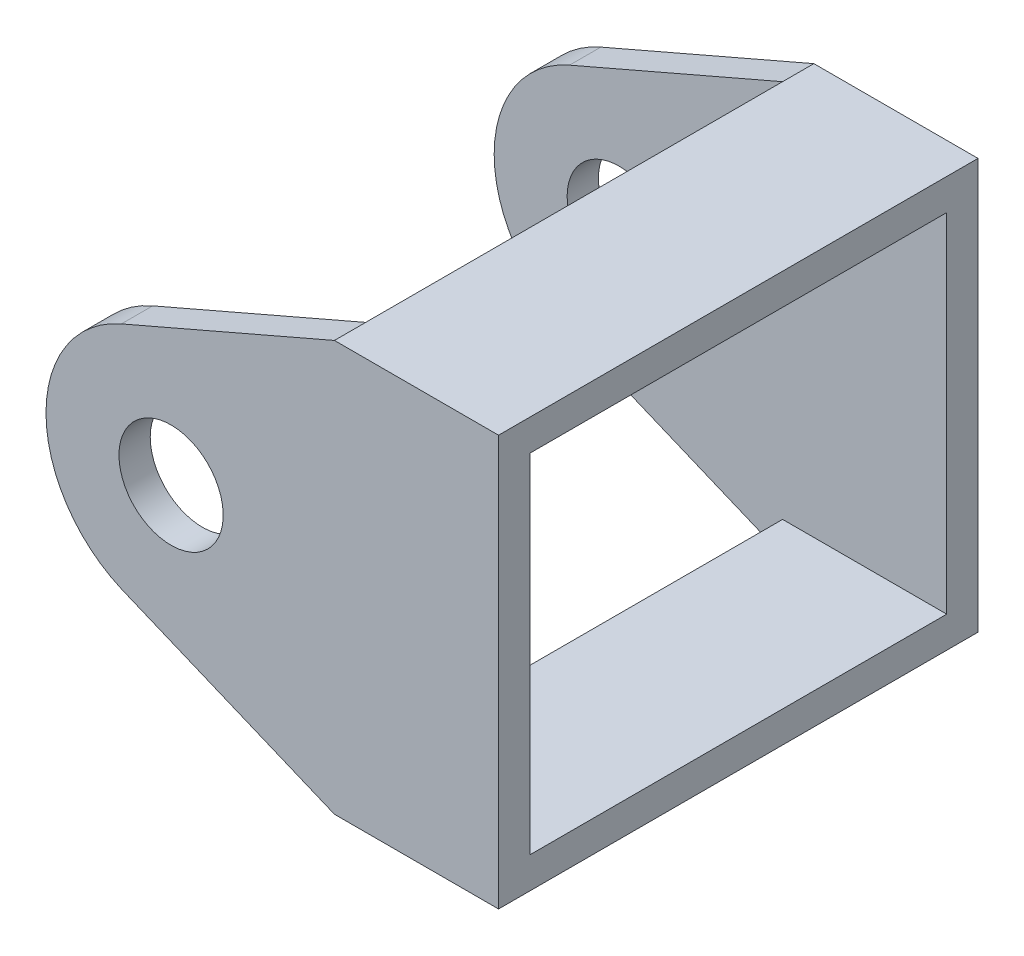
from build123d import *

# Parameters (mm, degrees)
SKETCH1_R               = 6.35
BOSS_EXTRUDE1_DEPTH     = 58.42
CUT_EXTRUDE1_DEPTH      = 20
CUT_EXTRUDE1_DEPTH_BACK = 85.135726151
SKETCH2_W               = 50.8
SKETCH2_H               = 42.38
CUT_EXTRUDE2_DEPTH      = 15
CUT_EXTRUDE2_DEPTH_BACK = 59
SKETCH3_W               = 14.655181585
SKETCH3_H               = 50.8


with BuildPart() as part:
    # Sketch1 → Boss-Extrude1 (new body)
    with BuildSketch(Plane.XY):
        with BuildLine():
            Line((0, 25), (-20, 25))
            Line((-20, 25), (-45.957720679, 13.7657403))
            ThreePointArc((-45.957720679, 13.7657403), (-55.144573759, -0.220574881), (-45.957720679, -14.206890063))
            Line((-45.957720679, -14.206890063), (-20, -25))
            Line((-20, -25), (0, -25))
            Line((0, -25), (0, 25))
        make_face()
        with Locations(Location((-39.904573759, -0.220574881, 0), (0, 0, 180))):
            Circle(SKETCH1_R, mode=Mode.SUBTRACT)
    extrude(amount=BOSS_EXTRUDE1_DEPTH)

    # Sketch2 → Cut-Extrude1 (cut, two sides: drawn at the far end of the back side and taken through both)
    with BuildSketch(Plane(origin=(0, 0, 0), x_dir=(0, 0, -1), z_dir=(1, 0, 0)).offset(-CUT_EXTRUDE1_DEPTH_BACK)):
        with Locations((-29.21, 0)):
            Rectangle(SKETCH2_W, SKETCH2_H)
    extrude(amount=CUT_EXTRUDE1_DEPTH + CUT_EXTRUDE1_DEPTH_BACK, mode=Mode.SUBTRACT)

    # Sketch3 → Cut-Extrude2 (cut, two sides: drawn at the far end of the back side and taken through both)
    with BuildSketch(Plane(origin=(0, 25, 0), x_dir=(1, 0, 0), z_dir=(0, 1, 0)).offset(-CUT_EXTRUDE2_DEPTH_BACK)):
        with Locations((-27.327590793, -29.21)):
            Rectangle(SKETCH3_W, SKETCH3_H)
    extrude(amount=CUT_EXTRUDE2_DEPTH + CUT_EXTRUDE2_DEPTH_BACK, mode=Mode.SUBTRACT)


solid = part.part
